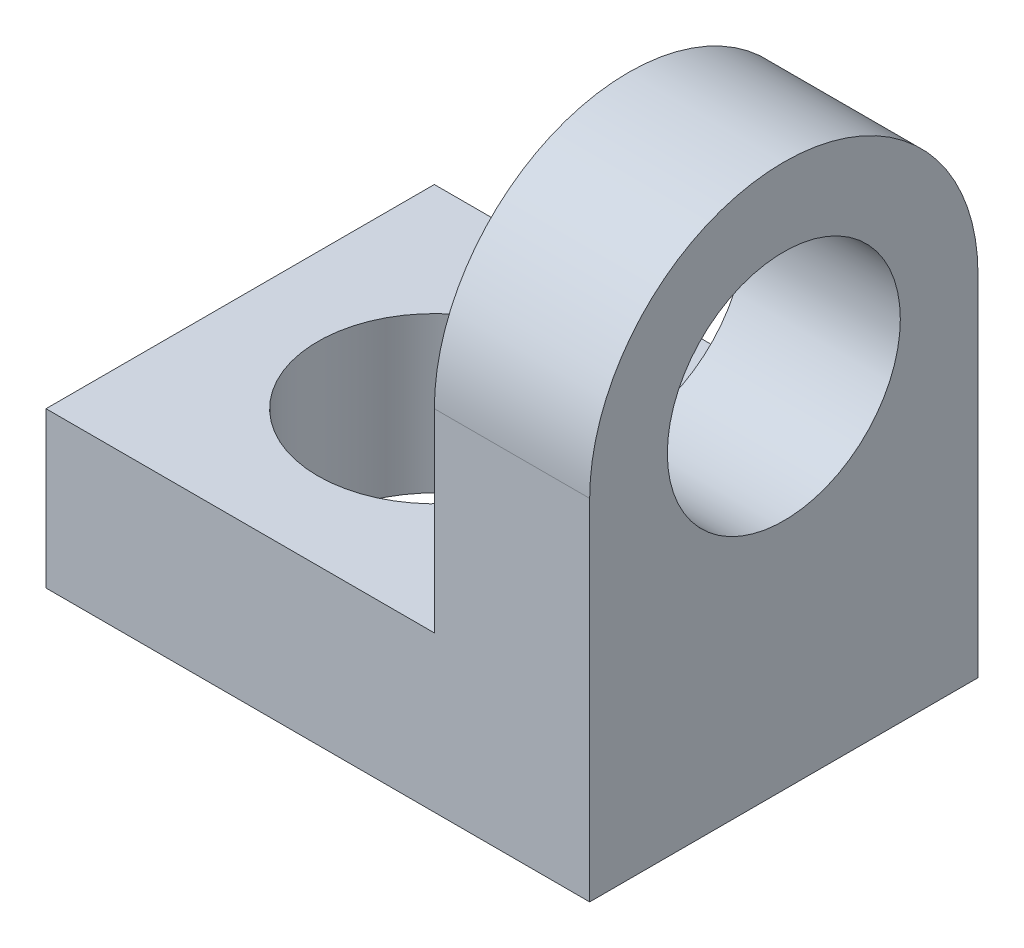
ISO-10303-21;
HEADER;
FILE_DESCRIPTION(('STEP AP214'),'2;1');
FILE_NAME('part.step','',(''),(''),'','','');
FILE_SCHEMA(('AUTOMOTIVE_DESIGN { 1 0 10303 214 1 1 1 1 }'));
ENDSEC;
DATA;
#1=APPLICATION_CONTEXT('core data for automotive mechanical design processes');
#2=APPLICATION_PROTOCOL_DEFINITION('international standard','automotive_design',2000,#1);
#3=PRODUCT_CONTEXT('',#1,'mechanical');
#4=PRODUCT('Part','Part','',(#3));
#5=PRODUCT_RELATED_PRODUCT_CATEGORY('part','',(#4));
#6=PRODUCT_DEFINITION_FORMATION('','',#4);
#7=PRODUCT_DEFINITION_CONTEXT('part definition',#1,'design');
#8=PRODUCT_DEFINITION('design','',#6,#7);
#9=PRODUCT_DEFINITION_SHAPE('','',#8);
#10=(LENGTH_UNIT() NAMED_UNIT(*) SI_UNIT(.MILLI.,.METRE.));
#11=(NAMED_UNIT(*) PLANE_ANGLE_UNIT() SI_UNIT($,.RADIAN.));
#12=(NAMED_UNIT(*) SI_UNIT($,.STERADIAN.) SOLID_ANGLE_UNIT());
#13=UNCERTAINTY_MEASURE_WITH_UNIT(LENGTH_MEASURE(1.E-05),#10,'distance_accuracy_value','');
#14=(GEOMETRIC_REPRESENTATION_CONTEXT(3) GLOBAL_UNCERTAINTY_ASSIGNED_CONTEXT((#13)) GLOBAL_UNIT_ASSIGNED_CONTEXT((#10,
#11,#12)) REPRESENTATION_CONTEXT('',''));
#15=CARTESIAN_POINT('',(0.,0.,0.));
#16=DIRECTION('',(0.,0.,1.));
#17=DIRECTION('',(1.,0.,0.));
#18=AXIS2_PLACEMENT_3D('',#15,#16,#17);
#19=CARTESIAN_POINT('',(28.,18.,-10.));
#20=DIRECTION('',(1.,0.,0.));
#21=DIRECTION('',(0.,0.,-1.));
#22=AXIS2_PLACEMENT_3D('',#19,#20,#21);
#23=CYLINDRICAL_SURFACE('',#22,10.);
#24=DIRECTION('',(-1.,0.,0.));
#25=VECTOR('',#24,1.);
#26=CARTESIAN_POINT('',(28.,18.,0.));
#27=LINE('',#26,#25);
#28=CARTESIAN_POINT('',(28.,18.,0.));
#29=VERTEX_POINT('',#28);
#30=CARTESIAN_POINT('',(20.,18.,0.));
#31=VERTEX_POINT('',#30);
#32=EDGE_CURVE('E87',#29,#31,#27,.T.);
#33=ORIENTED_EDGE('',*,*,#32,.F.);
#34=CARTESIAN_POINT('',(28.,18.,-10.));
#35=DIRECTION('',(-1.,0.,0.));
#36=DIRECTION('',(0.,0.,1.));
#37=AXIS2_PLACEMENT_3D('',#34,#35,#36);
#38=CIRCLE('',#37,10.);
#39=CARTESIAN_POINT('',(28.,18.,-20.));
#40=VERTEX_POINT('',#39);
#41=EDGE_CURVE('E39',#40,#29,#38,.F.);
#42=ORIENTED_EDGE('',*,*,#41,.F.);
#43=DIRECTION('',(-1.,0.,0.));
#44=VECTOR('',#43,1.);
#45=CARTESIAN_POINT('',(28.,18.,-20.));
#46=LINE('',#45,#44);
#47=CARTESIAN_POINT('',(20.,18.,-20.));
#48=VERTEX_POINT('',#47);
#49=EDGE_CURVE('E142',#48,#40,#46,.F.);
#50=ORIENTED_EDGE('',*,*,#49,.F.);
#51=CARTESIAN_POINT('',(20.,18.,-10.));
#52=DIRECTION('',(1.,0.,0.));
#53=DIRECTION('',(0.,0.,-1.));
#54=AXIS2_PLACEMENT_3D('',#51,#52,#53);
#55=CIRCLE('',#54,10.);
#56=EDGE_CURVE('E11',#31,#48,#55,.F.);
#57=ORIENTED_EDGE('',*,*,#56,.F.);
#58=EDGE_LOOP('',(#33,#42,#50,#57));
#59=FACE_BOUND('',#58,.T.);
#60=ADVANCED_FACE('F31',(#59),#23,.T.);
#61=CARTESIAN_POINT('',(0.,8.,-20.));
#62=DIRECTION('',(0.,-1.,0.));
#63=DIRECTION('',(0.,0.,-1.));
#64=AXIS2_PLACEMENT_3D('',#61,#62,#63);
#65=PLANE('',#64);
#66=CARTESIAN_POINT('',(10.,8.,-10.));
#67=DIRECTION('',(0.,1.,0.));
#68=DIRECTION('',(0.,0.,1.));
#69=AXIS2_PLACEMENT_3D('',#66,#67,#68);
#70=CIRCLE('',#69,6.);
#71=CARTESIAN_POINT('',(10.,8.,-4.));
#72=VERTEX_POINT('',#71);
#73=EDGE_CURVE('E253',#72,#72,#70,.T.);
#74=ORIENTED_EDGE('',*,*,#73,.F.);
#75=EDGE_LOOP('',(#74));
#76=FACE_BOUND('',#75,.T.);
#77=DIRECTION('',(0.,0.,1.));
#78=VECTOR('',#77,1.);
#79=CARTESIAN_POINT('',(20.,8.,-20.));
#80=LINE('',#79,#78);
#81=CARTESIAN_POINT('',(20.,8.,-20.));
#82=VERTEX_POINT('',#81);
#83=CARTESIAN_POINT('',(20.,8.,0.));
#84=VERTEX_POINT('',#83);
#85=EDGE_CURVE('E95',#82,#84,#80,.T.);
#86=ORIENTED_EDGE('',*,*,#85,.F.);
#87=DIRECTION('',(-1.,0.,0.));
#88=VECTOR('',#87,1.);
#89=CARTESIAN_POINT('',(0.,8.,-20.));
#90=LINE('',#89,#88);
#91=CARTESIAN_POINT('',(0.,8.,-20.));
#92=VERTEX_POINT('',#91);
#93=EDGE_CURVE('E100',#82,#92,#90,.T.);
#94=ORIENTED_EDGE('',*,*,#93,.T.);
#95=DIRECTION('',(0.,0.,1.));
#96=VECTOR('',#95,1.);
#97=CARTESIAN_POINT('',(0.,8.,0.));
#98=LINE('',#97,#96);
#99=CARTESIAN_POINT('',(0.,8.,0.));
#100=VERTEX_POINT('',#99);
#101=EDGE_CURVE('E98',#92,#100,#98,.T.);
#102=ORIENTED_EDGE('',*,*,#101,.T.);
#103=DIRECTION('',(1.,0.,0.));
#104=VECTOR('',#103,1.);
#105=CARTESIAN_POINT('',(0.,8.,0.));
#106=LINE('',#105,#104);
#107=EDGE_CURVE('E85',#100,#84,#106,.T.);
#108=ORIENTED_EDGE('',*,*,#107,.T.);
#109=EDGE_LOOP('',(#86,#94,#102,#108));
#110=FACE_BOUND('',#109,.T.);
#111=ADVANCED_FACE('F94',(#76,#110),#65,.F.);
#112=CARTESIAN_POINT('',(0.,8.,0.));
#113=DIRECTION('',(1.,0.,0.));
#114=DIRECTION('',(0.,0.,-1.));
#115=AXIS2_PLACEMENT_3D('',#112,#113,#114);
#116=PLANE('',#115);
#117=DIRECTION('',(0.,0.,1.));
#118=VECTOR('',#117,1.);
#119=CARTESIAN_POINT('',(0.,0.,0.));
#120=LINE('',#119,#118);
#121=CARTESIAN_POINT('',(0.,0.,-20.));
#122=VERTEX_POINT('',#121);
#123=CARTESIAN_POINT('',(0.,0.,0.));
#124=VERTEX_POINT('',#123);
#125=EDGE_CURVE('E89',#122,#124,#120,.T.);
#126=ORIENTED_EDGE('',*,*,#125,.T.);
#127=DIRECTION('',(0.,-1.,0.));
#128=VECTOR('',#127,1.);
#129=CARTESIAN_POINT('',(0.,8.,0.));
#130=LINE('',#129,#128);
#131=EDGE_CURVE('E125',#100,#124,#130,.T.);
#132=ORIENTED_EDGE('',*,*,#131,.F.);
#133=ORIENTED_EDGE('',*,*,#101,.F.);
#134=DIRECTION('',(0.,-1.,0.));
#135=VECTOR('',#134,1.);
#136=CARTESIAN_POINT('',(0.,8.,-20.));
#137=LINE('',#136,#135);
#138=EDGE_CURVE('E127',#92,#122,#137,.T.);
#139=ORIENTED_EDGE('',*,*,#138,.T.);
#140=EDGE_LOOP('',(#126,#132,#133,#139));
#141=FACE_BOUND('',#140,.T.);
#142=ADVANCED_FACE('F155',(#141),#116,.F.);
#143=CARTESIAN_POINT('',(0.,8.,0.));
#144=DIRECTION('',(0.,0.,-1.));
#145=DIRECTION('',(-1.,0.,0.));
#146=AXIS2_PLACEMENT_3D('',#143,#144,#145);
#147=PLANE('',#146);
#148=DIRECTION('',(0.,-1.,0.));
#149=VECTOR('',#148,1.);
#150=CARTESIAN_POINT('',(28.,8.,0.));
#151=LINE('',#150,#149);
#152=CARTESIAN_POINT('',(28.,0.,0.));
#153=VERTEX_POINT('',#152);
#154=EDGE_CURVE('E135',#29,#153,#151,.T.);
#155=ORIENTED_EDGE('',*,*,#154,.F.);
#156=ORIENTED_EDGE('',*,*,#32,.T.);
#157=DIRECTION('',(0.,-1.,0.));
#158=VECTOR('',#157,1.);
#159=CARTESIAN_POINT('',(20.,28.,0.));
#160=LINE('',#159,#158);
#161=EDGE_CURVE('E80',#31,#84,#160,.T.);
#162=ORIENTED_EDGE('',*,*,#161,.T.);
#163=ORIENTED_EDGE('',*,*,#107,.F.);
#164=ORIENTED_EDGE('',*,*,#131,.T.);
#165=DIRECTION('',(1.,0.,0.));
#166=VECTOR('',#165,1.);
#167=CARTESIAN_POINT('',(0.,0.,0.));
#168=LINE('',#167,#166);
#169=EDGE_CURVE('E148',#124,#153,#168,.T.);
#170=ORIENTED_EDGE('',*,*,#169,.T.);
#171=EDGE_LOOP('',(#155,#156,#162,#163,#164,#170));
#172=FACE_BOUND('',#171,.T.);
#173=ADVANCED_FACE('F83',(#172),#147,.F.);
#174=CARTESIAN_POINT('',(28.,8.,0.));
#175=DIRECTION('',(-1.,0.,0.));
#176=DIRECTION('',(0.,0.,1.));
#177=AXIS2_PLACEMENT_3D('',#174,#175,#176);
#178=PLANE('',#177);
#179=CARTESIAN_POINT('',(28.,18.,-10.));
#180=DIRECTION('',(1.,0.,0.));
#181=DIRECTION('',(0.,0.,-1.));
#182=AXIS2_PLACEMENT_3D('',#179,#180,#181);
#183=CIRCLE('',#182,6.);
#184=CARTESIAN_POINT('',(28.,18.,-16.));
#185=VERTEX_POINT('',#184);
#186=EDGE_CURVE('E107',#185,#185,#183,.T.);
#187=ORIENTED_EDGE('',*,*,#186,.F.);
#188=EDGE_LOOP('',(#187));
#189=FACE_BOUND('',#188,.T.);
#190=DIRECTION('',(0.,-1.,0.));
#191=VECTOR('',#190,1.);
#192=CARTESIAN_POINT('',(28.,8.,-20.));
#193=LINE('',#192,#191);
#194=CARTESIAN_POINT('',(28.,0.,-20.));
#195=VERTEX_POINT('',#194);
#196=EDGE_CURVE('E130',#40,#195,#193,.T.);
#197=ORIENTED_EDGE('',*,*,#196,.F.);
#198=ORIENTED_EDGE('',*,*,#41,.T.);
#199=ORIENTED_EDGE('',*,*,#154,.T.);
#200=DIRECTION('',(0.,0.,-1.));
#201=VECTOR('',#200,1.);
#202=CARTESIAN_POINT('',(28.,0.,0.));
#203=LINE('',#202,#201);
#204=EDGE_CURVE('E151',#153,#195,#203,.T.);
#205=ORIENTED_EDGE('',*,*,#204,.T.);
#206=EDGE_LOOP('',(#197,#198,#199,#205));
#207=FACE_BOUND('',#206,.T.);
#208=ADVANCED_FACE('F147',(#189,#207),#178,.F.);
#209=CARTESIAN_POINT('',(0.,8.,-20.));
#210=DIRECTION('',(0.,0.,1.));
#211=DIRECTION('',(1.,0.,0.));
#212=AXIS2_PLACEMENT_3D('',#209,#210,#211);
#213=PLANE('',#212);
#214=DIRECTION('',(0.,-1.,0.));
#215=VECTOR('',#214,1.);
#216=CARTESIAN_POINT('',(20.,28.,-20.));
#217=LINE('',#216,#215);
#218=EDGE_CURVE('E90',#48,#82,#217,.T.);
#219=ORIENTED_EDGE('',*,*,#218,.F.);
#220=ORIENTED_EDGE('',*,*,#49,.T.);
#221=ORIENTED_EDGE('',*,*,#196,.T.);
#222=DIRECTION('',(-1.,0.,0.));
#223=VECTOR('',#222,1.);
#224=CARTESIAN_POINT('',(0.,0.,-20.));
#225=LINE('',#224,#223);
#226=EDGE_CURVE('E119',#195,#122,#225,.T.);
#227=ORIENTED_EDGE('',*,*,#226,.T.);
#228=ORIENTED_EDGE('',*,*,#138,.F.);
#229=ORIENTED_EDGE('',*,*,#93,.F.);
#230=EDGE_LOOP('',(#219,#220,#221,#227,#228,#229));
#231=FACE_BOUND('',#230,.T.);
#232=ADVANCED_FACE('F188',(#231),#213,.F.);
#233=CARTESIAN_POINT('',(0.,0.,-20.));
#234=DIRECTION('',(0.,-1.,0.));
#235=DIRECTION('',(0.,0.,-1.));
#236=AXIS2_PLACEMENT_3D('',#233,#234,#235);
#237=PLANE('',#236);
#238=CARTESIAN_POINT('',(10.,0.,-10.));
#239=DIRECTION('',(0.,1.,0.));
#240=DIRECTION('',(0.,0.,1.));
#241=AXIS2_PLACEMENT_3D('',#238,#239,#240);
#242=CIRCLE('',#241,6.);
#243=CARTESIAN_POINT('',(10.,0.,-4.));
#244=VERTEX_POINT('',#243);
#245=EDGE_CURVE('E251',#244,#244,#242,.T.);
#246=ORIENTED_EDGE('',*,*,#245,.T.);
#247=EDGE_LOOP('',(#246));
#248=FACE_BOUND('',#247,.T.);
#249=ORIENTED_EDGE('',*,*,#125,.F.);
#250=ORIENTED_EDGE('',*,*,#226,.F.);
#251=ORIENTED_EDGE('',*,*,#204,.F.);
#252=ORIENTED_EDGE('',*,*,#169,.F.);
#253=EDGE_LOOP('',(#249,#250,#251,#252));
#254=FACE_BOUND('',#253,.T.);
#255=ADVANCED_FACE('F154',(#248,#254),#237,.T.);
#256=CARTESIAN_POINT('',(20.,28.,-20.));
#257=DIRECTION('',(1.,0.,0.));
#258=DIRECTION('',(0.,0.,-1.));
#259=AXIS2_PLACEMENT_3D('',#256,#257,#258);
#260=PLANE('',#259);
#261=CARTESIAN_POINT('',(20.,18.,-10.));
#262=DIRECTION('',(1.,0.,0.));
#263=DIRECTION('',(0.,0.,-1.));
#264=AXIS2_PLACEMENT_3D('',#261,#262,#263);
#265=CIRCLE('',#264,6.);
#266=CARTESIAN_POINT('',(20.,18.,-16.));
#267=VERTEX_POINT('',#266);
#268=EDGE_CURVE('E34',#267,#267,#265,.T.);
#269=ORIENTED_EDGE('',*,*,#268,.T.);
#270=EDGE_LOOP('',(#269));
#271=FACE_BOUND('',#270,.T.);
#272=ORIENTED_EDGE('',*,*,#161,.F.);
#273=ORIENTED_EDGE('',*,*,#56,.T.);
#274=ORIENTED_EDGE('',*,*,#218,.T.);
#275=ORIENTED_EDGE('',*,*,#85,.T.);
#276=EDGE_LOOP('',(#272,#273,#274,#275));
#277=FACE_BOUND('',#276,.T.);
#278=ADVANCED_FACE('F102',(#271,#277),#260,.F.);
#279=CARTESIAN_POINT('',(-2.50000000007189E-05,18.,-10.));
#280=DIRECTION('',(1.,0.,0.));
#281=DIRECTION('',(0.,0.,-1.));
#282=AXIS2_PLACEMENT_3D('',#279,#280,#281);
#283=CYLINDRICAL_SURFACE('',#282,6.);
#284=ORIENTED_EDGE('',*,*,#186,.T.);
#285=EDGE_LOOP('',(#284));
#286=FACE_BOUND('',#285,.T.);
#287=ORIENTED_EDGE('',*,*,#268,.F.);
#288=EDGE_LOOP('',(#287));
#289=FACE_BOUND('',#288,.T.);
#290=ADVANCED_FACE('F180',(#286,#289),#283,.F.);
#291=CARTESIAN_POINT('',(10.,0.,-10.));
#292=DIRECTION('',(0.,1.,0.));
#293=DIRECTION('',(0.,0.,1.));
#294=AXIS2_PLACEMENT_3D('',#291,#292,#293);
#295=CYLINDRICAL_SURFACE('',#294,6.);
#296=ORIENTED_EDGE('',*,*,#245,.F.);
#297=EDGE_LOOP('',(#296));
#298=FACE_BOUND('',#297,.T.);
#299=ORIENTED_EDGE('',*,*,#73,.T.);
#300=EDGE_LOOP('',(#299));
#301=FACE_BOUND('',#300,.T.);
#302=ADVANCED_FACE('F197',(#298,#301),#295,.F.);
#303=CLOSED_SHELL('',(#60,#111,#142,#173,#208,#232,#255,#278,#290,#302));
#304=MANIFOLD_SOLID_BREP('B2',#303);
#305=ADVANCED_BREP_SHAPE_REPRESENTATION('',(#18,#304),#14);
#306=SHAPE_DEFINITION_REPRESENTATION(#9,#305);
ENDSEC;
END-ISO-10303-21;
